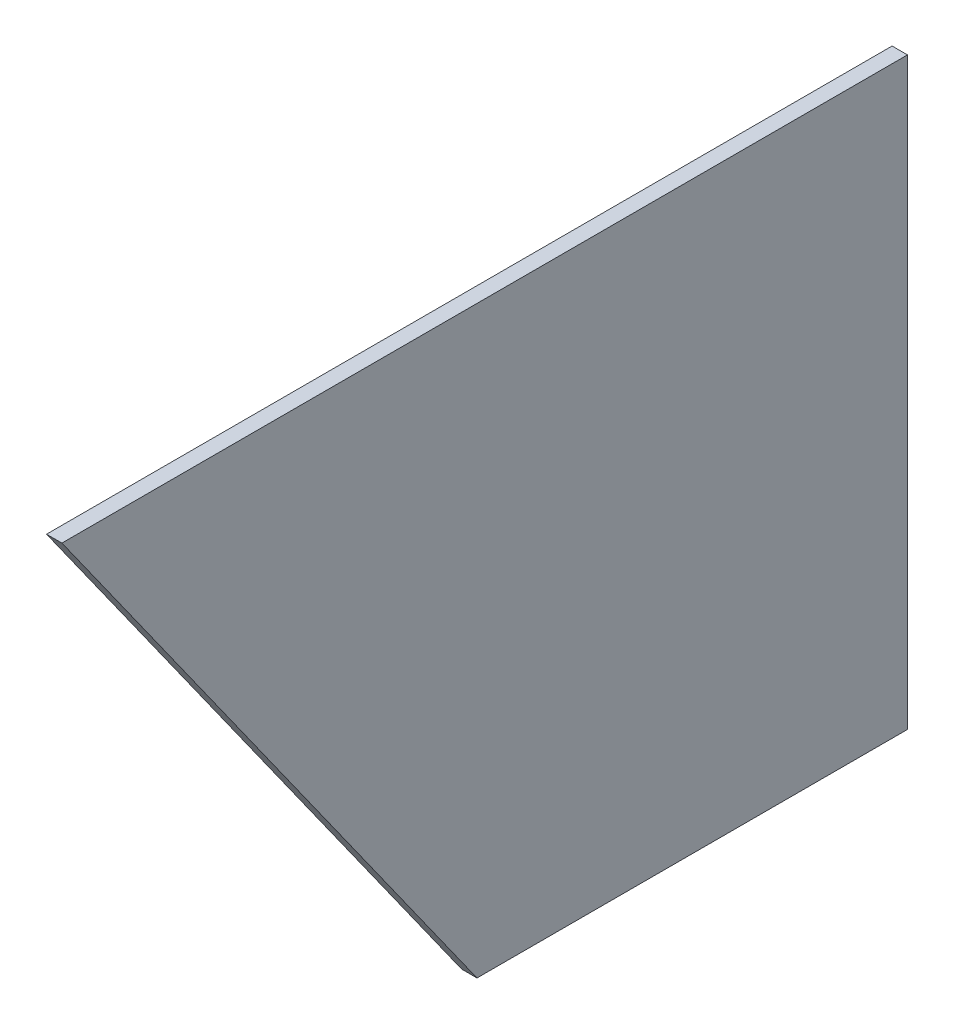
ISO-10303-21;
HEADER;
FILE_DESCRIPTION(('STEP AP214'),'2;1');
FILE_NAME('part.step','',(''),(''),'','','');
FILE_SCHEMA(('AUTOMOTIVE_DESIGN { 1 0 10303 214 1 1 1 1 }'));
ENDSEC;
DATA;
#1=APPLICATION_CONTEXT('core data for automotive mechanical design processes');
#2=APPLICATION_PROTOCOL_DEFINITION('international standard','automotive_design',2000,#1);
#3=PRODUCT_CONTEXT('',#1,'mechanical');
#4=PRODUCT('Part','Part','',(#3));
#5=PRODUCT_RELATED_PRODUCT_CATEGORY('part','',(#4));
#6=PRODUCT_DEFINITION_FORMATION('','',#4);
#7=PRODUCT_DEFINITION_CONTEXT('part definition',#1,'design');
#8=PRODUCT_DEFINITION('design','',#6,#7);
#9=PRODUCT_DEFINITION_SHAPE('','',#8);
#10=(LENGTH_UNIT() NAMED_UNIT(*) SI_UNIT(.MILLI.,.METRE.));
#11=(NAMED_UNIT(*) PLANE_ANGLE_UNIT() SI_UNIT($,.RADIAN.));
#12=(NAMED_UNIT(*) SI_UNIT($,.STERADIAN.) SOLID_ANGLE_UNIT());
#13=UNCERTAINTY_MEASURE_WITH_UNIT(LENGTH_MEASURE(1.E-05),#10,'distance_accuracy_value','');
#14=(GEOMETRIC_REPRESENTATION_CONTEXT(3) GLOBAL_UNCERTAINTY_ASSIGNED_CONTEXT((#13)) GLOBAL_UNIT_ASSIGNED_CONTEXT((#10,
#11,#12)) REPRESENTATION_CONTEXT('',''));
#15=CARTESIAN_POINT('',(0.,0.,0.));
#16=DIRECTION('',(0.,0.,1.));
#17=DIRECTION('',(1.,0.,0.));
#18=AXIS2_PLACEMENT_3D('',#15,#16,#17);
#19=CARTESIAN_POINT('',(3.,0.,0.));
#20=DIRECTION('',(0.,0.,1.));
#21=DIRECTION('',(1.,0.,0.));
#22=AXIS2_PLACEMENT_3D('',#19,#20,#21);
#23=PLANE('',#22);
#24=DIRECTION('',(0.,1.,0.));
#25=VECTOR('',#24,1.);
#26=CARTESIAN_POINT('',(0.,0.,0.));
#27=LINE('',#26,#25);
#28=CARTESIAN_POINT('',(0.,0.,0.));
#29=VERTEX_POINT('',#28);
#30=CARTESIAN_POINT('',(0.,114.,0.));
#31=VERTEX_POINT('',#30);
#32=EDGE_CURVE('E106',#29,#31,#27,.T.);
#33=ORIENTED_EDGE('',*,*,#32,.T.);
#34=DIRECTION('',(-1.,0.,0.));
#35=VECTOR('',#34,1.);
#36=CARTESIAN_POINT('',(3.,114.,0.));
#37=LINE('',#36,#35);
#38=CARTESIAN_POINT('',(3.,114.,0.));
#39=VERTEX_POINT('',#38);
#40=EDGE_CURVE('E11',#39,#31,#37,.T.);
#41=ORIENTED_EDGE('',*,*,#40,.F.);
#42=DIRECTION('',(0.,1.,0.));
#43=VECTOR('',#42,1.);
#44=CARTESIAN_POINT('',(3.,0.,0.));
#45=LINE('',#44,#43);
#46=CARTESIAN_POINT('',(3.,0.,0.));
#47=VERTEX_POINT('',#46);
#48=EDGE_CURVE('E94',#47,#39,#45,.T.);
#49=ORIENTED_EDGE('',*,*,#48,.F.);
#50=DIRECTION('',(-1.,0.,0.));
#51=VECTOR('',#50,1.);
#52=CARTESIAN_POINT('',(3.,0.,0.));
#53=LINE('',#52,#51);
#54=EDGE_CURVE('E102',#47,#29,#53,.T.);
#55=ORIENTED_EDGE('',*,*,#54,.T.);
#56=EDGE_LOOP('',(#33,#41,#49,#55));
#57=FACE_BOUND('',#56,.T.);
#58=ADVANCED_FACE('F43',(#57),#23,.F.);
#59=CARTESIAN_POINT('',(3.,114.,165.));
#60=DIRECTION('',(0.,-1.,0.));
#61=DIRECTION('',(0.,0.,-1.));
#62=AXIS2_PLACEMENT_3D('',#59,#60,#61);
#63=PLANE('',#62);
#64=DIRECTION('',(0.,0.,1.));
#65=VECTOR('',#64,1.);
#66=CARTESIAN_POINT('',(0.,114.,165.));
#67=LINE('',#66,#65);
#68=CARTESIAN_POINT('',(0.,114.,165.));
#69=VERTEX_POINT('',#68);
#70=EDGE_CURVE('E98',#31,#69,#67,.T.);
#71=ORIENTED_EDGE('',*,*,#70,.T.);
#72=DIRECTION('',(-1.,0.,0.));
#73=VECTOR('',#72,1.);
#74=CARTESIAN_POINT('',(3.,114.,165.));
#75=LINE('',#74,#73);
#76=CARTESIAN_POINT('',(3.,114.,165.));
#77=VERTEX_POINT('',#76);
#78=EDGE_CURVE('E51',#77,#69,#75,.T.);
#79=ORIENTED_EDGE('',*,*,#78,.F.);
#80=DIRECTION('',(0.,0.,1.));
#81=VECTOR('',#80,1.);
#82=CARTESIAN_POINT('',(3.,114.,165.));
#83=LINE('',#82,#81);
#84=EDGE_CURVE('E89',#39,#77,#83,.T.);
#85=ORIENTED_EDGE('',*,*,#84,.F.);
#86=ORIENTED_EDGE('',*,*,#40,.T.);
#87=EDGE_LOOP('',(#71,#79,#85,#86));
#88=FACE_BOUND('',#87,.T.);
#89=ADVANCED_FACE('F97',(#88),#63,.F.);
#90=CARTESIAN_POINT('',(3.,114.,165.));
#91=DIRECTION('',(0.,0.579207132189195,-0.815180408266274));
#92=DIRECTION('',(0.,0.815180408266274,0.579207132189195));
#93=AXIS2_PLACEMENT_3D('',#90,#91,#92);
#94=PLANE('',#93);
#95=DIRECTION('',(0.,-0.815180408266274,-0.579207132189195));
#96=VECTOR('',#95,1.);
#97=CARTESIAN_POINT('',(0.,114.,165.));
#98=LINE('',#97,#96);
#99=CARTESIAN_POINT('',(0.,0.,84.));
#100=VERTEX_POINT('',#99);
#101=EDGE_CURVE('E76',#69,#100,#98,.T.);
#102=ORIENTED_EDGE('',*,*,#101,.T.);
#103=DIRECTION('',(-1.,0.,0.));
#104=VECTOR('',#103,1.);
#105=CARTESIAN_POINT('',(3.,0.,84.));
#106=LINE('',#105,#104);
#107=CARTESIAN_POINT('',(3.,0.,84.));
#108=VERTEX_POINT('',#107);
#109=EDGE_CURVE('E99',#108,#100,#106,.T.);
#110=ORIENTED_EDGE('',*,*,#109,.F.);
#111=DIRECTION('',(0.,-0.815180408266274,-0.579207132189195));
#112=VECTOR('',#111,1.);
#113=CARTESIAN_POINT('',(3.,114.,165.));
#114=LINE('',#113,#112);
#115=EDGE_CURVE('E92',#77,#108,#114,.T.);
#116=ORIENTED_EDGE('',*,*,#115,.F.);
#117=ORIENTED_EDGE('',*,*,#78,.T.);
#118=EDGE_LOOP('',(#102,#110,#116,#117));
#119=FACE_BOUND('',#118,.T.);
#120=ADVANCED_FACE('F100',(#119),#94,.F.);
#121=CARTESIAN_POINT('',(3.,0.,84.));
#122=DIRECTION('',(0.,1.,0.));
#123=DIRECTION('',(0.,0.,1.));
#124=AXIS2_PLACEMENT_3D('',#121,#122,#123);
#125=PLANE('',#124);
#126=DIRECTION('',(0.,0.,-1.));
#127=VECTOR('',#126,1.);
#128=CARTESIAN_POINT('',(0.,0.,84.));
#129=LINE('',#128,#127);
#130=EDGE_CURVE('E82',#100,#29,#129,.T.);
#131=ORIENTED_EDGE('',*,*,#130,.T.);
#132=ORIENTED_EDGE('',*,*,#54,.F.);
#133=DIRECTION('',(0.,0.,-1.));
#134=VECTOR('',#133,1.);
#135=CARTESIAN_POINT('',(3.,0.,84.));
#136=LINE('',#135,#134);
#137=EDGE_CURVE('E59',#108,#47,#136,.T.);
#138=ORIENTED_EDGE('',*,*,#137,.F.);
#139=ORIENTED_EDGE('',*,*,#109,.T.);
#140=EDGE_LOOP('',(#131,#132,#138,#139));
#141=FACE_BOUND('',#140,.T.);
#142=ADVANCED_FACE('F113',(#141),#125,.F.);
#143=CARTESIAN_POINT('',(3.,0.,0.));
#144=DIRECTION('',(-1.,0.,0.));
#145=DIRECTION('',(0.,0.,1.));
#146=AXIS2_PLACEMENT_3D('',#143,#144,#145);
#147=PLANE('',#146);
#148=ORIENTED_EDGE('',*,*,#48,.T.);
#149=ORIENTED_EDGE('',*,*,#84,.T.);
#150=ORIENTED_EDGE('',*,*,#115,.T.);
#151=ORIENTED_EDGE('',*,*,#137,.T.);
#152=EDGE_LOOP('',(#148,#149,#150,#151));
#153=FACE_BOUND('',#152,.T.);
#154=ADVANCED_FACE('F90',(#153),#147,.F.);
#155=CARTESIAN_POINT('',(0.,0.,0.));
#156=DIRECTION('',(-1.,0.,0.));
#157=DIRECTION('',(0.,0.,1.));
#158=AXIS2_PLACEMENT_3D('',#155,#156,#157);
#159=PLANE('',#158);
#160=ORIENTED_EDGE('',*,*,#32,.F.);
#161=ORIENTED_EDGE('',*,*,#130,.F.);
#162=ORIENTED_EDGE('',*,*,#101,.F.);
#163=ORIENTED_EDGE('',*,*,#70,.F.);
#164=EDGE_LOOP('',(#160,#161,#162,#163));
#165=FACE_BOUND('',#164,.T.);
#166=ADVANCED_FACE('F116',(#165),#159,.T.);
#167=CLOSED_SHELL('',(#58,#89,#120,#142,#154,#166));
#168=MANIFOLD_SOLID_BREP('B2',#167);
#169=ADVANCED_BREP_SHAPE_REPRESENTATION('',(#18,#168),#14);
#170=SHAPE_DEFINITION_REPRESENTATION(#9,#169);
ENDSEC;
END-ISO-10303-21;
